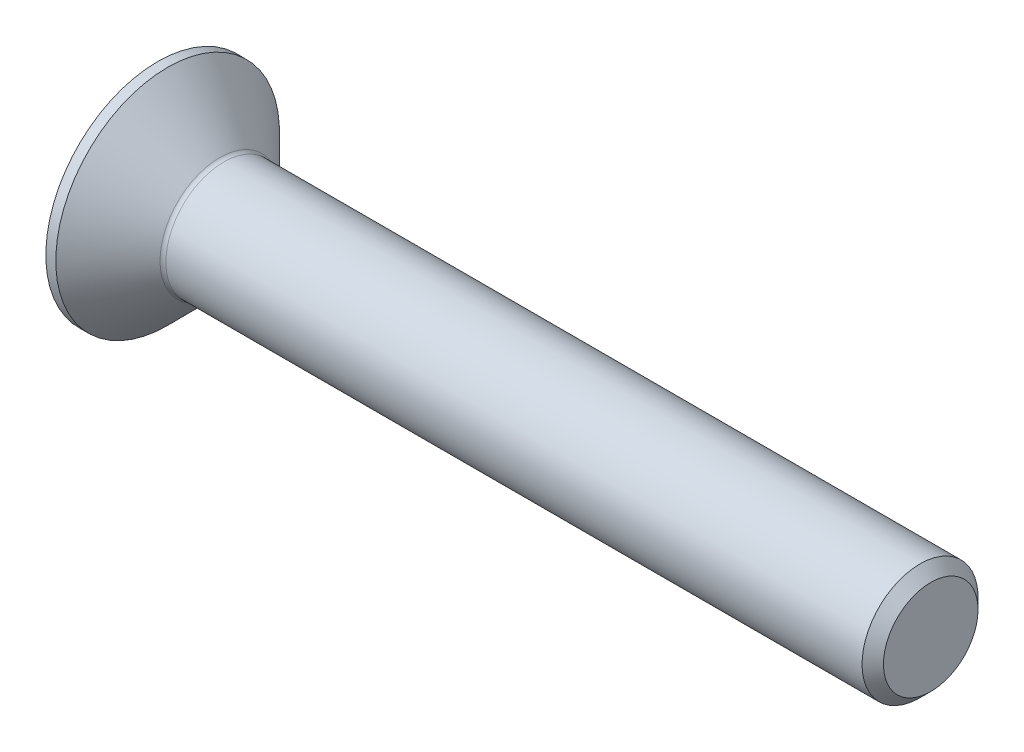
ISO-10303-21;
HEADER;
FILE_DESCRIPTION(('STEP AP214'),'2;1');
FILE_NAME('part.step','',(''),(''),'','','');
FILE_SCHEMA(('AUTOMOTIVE_DESIGN { 1 0 10303 214 1 1 1 1 }'));
ENDSEC;
DATA;
#1=APPLICATION_CONTEXT('core data for automotive mechanical design processes');
#2=APPLICATION_PROTOCOL_DEFINITION('international standard','automotive_design',2000,#1);
#3=PRODUCT_CONTEXT('',#1,'mechanical');
#4=PRODUCT('Part','Part','',(#3));
#5=PRODUCT_RELATED_PRODUCT_CATEGORY('part','',(#4));
#6=PRODUCT_DEFINITION_FORMATION('','',#4);
#7=PRODUCT_DEFINITION_CONTEXT('part definition',#1,'design');
#8=PRODUCT_DEFINITION('design','',#6,#7);
#9=PRODUCT_DEFINITION_SHAPE('','',#8);
#10=(LENGTH_UNIT() NAMED_UNIT(*) SI_UNIT(.MILLI.,.METRE.));
#11=(NAMED_UNIT(*) PLANE_ANGLE_UNIT() SI_UNIT($,.RADIAN.));
#12=(NAMED_UNIT(*) SI_UNIT($,.STERADIAN.) SOLID_ANGLE_UNIT());
#13=UNCERTAINTY_MEASURE_WITH_UNIT(LENGTH_MEASURE(1.E-05),#10,'distance_accuracy_value','');
#14=(GEOMETRIC_REPRESENTATION_CONTEXT(3) GLOBAL_UNCERTAINTY_ASSIGNED_CONTEXT((#13)) GLOBAL_UNIT_ASSIGNED_CONTEXT((#10,
#11,#12)) REPRESENTATION_CONTEXT('',''));
#15=CARTESIAN_POINT('',(0.,0.,0.));
#16=DIRECTION('',(0.,0.,1.));
#17=DIRECTION('',(1.,0.,0.));
#18=AXIS2_PLACEMENT_3D('',#15,#16,#17);
#19=CARTESIAN_POINT('',(0.,0.,0.));
#20=DIRECTION('',(-1.,0.,0.));
#21=DIRECTION('',(0.,-1.,0.));
#22=AXIS2_PLACEMENT_3D('',#19,#20,#21);
#23=PLANE('',#22);
#24=DIRECTION('',(0.,0.5,0.866025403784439));
#25=VECTOR('',#24,1.);
#26=CARTESIAN_POINT('',(0.,-2.32094808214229,0.));
#27=LINE('',#26,#25);
#28=CARTESIAN_POINT('',(0.,-2.32094808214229,0.));
#29=VERTEX_POINT('',#28);
#30=CARTESIAN_POINT('',(0.,-1.16047404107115,2.01));
#31=VERTEX_POINT('',#30);
#32=EDGE_CURVE('E54',#29,#31,#27,.T.);
#33=ORIENTED_EDGE('',*,*,#32,.F.);
#34=DIRECTION('',(0.,-0.5,0.866025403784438));
#35=VECTOR('',#34,1.);
#36=CARTESIAN_POINT('',(0.,-1.16047404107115,-2.01));
#37=LINE('',#36,#35);
#38=CARTESIAN_POINT('',(0.,-1.16047404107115,-2.01));
#39=VERTEX_POINT('',#38);
#40=EDGE_CURVE('E150',#39,#29,#37,.T.);
#41=ORIENTED_EDGE('',*,*,#40,.F.);
#42=DIRECTION('',(0.,-1.,0.));
#43=VECTOR('',#42,1.);
#44=CARTESIAN_POINT('',(0.,1.16047404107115,-2.01));
#45=LINE('',#44,#43);
#46=CARTESIAN_POINT('',(0.,1.16047404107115,-2.01));
#47=VERTEX_POINT('',#46);
#48=EDGE_CURVE('E147',#47,#39,#45,.T.);
#49=ORIENTED_EDGE('',*,*,#48,.F.);
#50=DIRECTION('',(0.,-0.5,-0.866025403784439));
#51=VECTOR('',#50,1.);
#52=CARTESIAN_POINT('',(0.,2.32094808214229,0.));
#53=LINE('',#52,#51);
#54=CARTESIAN_POINT('',(0.,2.32094808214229,0.));
#55=VERTEX_POINT('',#54);
#56=EDGE_CURVE('E104',#55,#47,#53,.T.);
#57=ORIENTED_EDGE('',*,*,#56,.F.);
#58=DIRECTION('',(0.,0.5,-0.866025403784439));
#59=VECTOR('',#58,1.);
#60=CARTESIAN_POINT('',(0.,1.16047404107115,2.01));
#61=LINE('',#60,#59);
#62=CARTESIAN_POINT('',(0.,1.16047404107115,2.01));
#63=VERTEX_POINT('',#62);
#64=EDGE_CURVE('E141',#63,#55,#61,.T.);
#65=ORIENTED_EDGE('',*,*,#64,.F.);
#66=DIRECTION('',(0.,1.,0.));
#67=VECTOR('',#66,1.);
#68=CARTESIAN_POINT('',(0.,-1.16047404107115,2.01));
#69=LINE('',#68,#67);
#70=EDGE_CURVE('E136',#31,#63,#69,.T.);
#71=ORIENTED_EDGE('',*,*,#70,.F.);
#72=EDGE_LOOP('',(#33,#41,#49,#57,#65,#71));
#73=FACE_BOUND('',#72,.T.);
#74=CARTESIAN_POINT('',(0.,0.,0.));
#75=DIRECTION('',(1.,0.,0.));
#76=DIRECTION('',(0.,1.,0.));
#77=AXIS2_PLACEMENT_3D('',#74,#75,#76);
#78=CIRCLE('',#77,5.785);
#79=CARTESIAN_POINT('',(0.,5.785,0.));
#80=VERTEX_POINT('',#79);
#81=EDGE_CURVE('E156',#80,#80,#78,.T.);
#82=ORIENTED_EDGE('',*,*,#81,.F.);
#83=EDGE_LOOP('',(#82));
#84=FACE_BOUND('',#83,.T.);
#85=ADVANCED_FACE('F39',(#73,#84),#23,.T.);
#86=CARTESIAN_POINT('',(40.,2.44550000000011,0.));
#87=DIRECTION('',(1.,0.,0.));
#88=DIRECTION('',(0.,1.,0.));
#89=AXIS2_PLACEMENT_3D('',#86,#87,#88);
#90=PLANE('',#89);
#91=CARTESIAN_POINT('',(40.,0.,0.));
#92=DIRECTION('',(1.,0.,0.));
#93=DIRECTION('',(0.,1.,0.));
#94=AXIS2_PLACEMENT_3D('',#91,#92,#93);
#95=CIRCLE('',#94,2.44550000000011);
#96=CARTESIAN_POINT('',(40.,2.44550000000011,0.));
#97=VERTEX_POINT('',#96);
#98=EDGE_CURVE('E11',#97,#97,#95,.T.);
#99=ORIENTED_EDGE('',*,*,#98,.T.);
#100=EDGE_LOOP('',(#99));
#101=FACE_BOUND('',#100,.T.);
#102=ADVANCED_FACE('F199',(#101),#90,.T.);
#103=CARTESIAN_POINT('',(40.,0.,0.));
#104=DIRECTION('',(-1.,0.,0.));
#105=DIRECTION('',(0.,-1.,0.));
#106=AXIS2_PLACEMENT_3D('',#103,#104,#105);
#107=CONICAL_SURFACE('',#106,2.44550000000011,0.785398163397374);
#108=CARTESIAN_POINT('',(39.4455,0.,0.));
#109=DIRECTION('',(1.,0.,0.));
#110=DIRECTION('',(0.,1.,0.));
#111=AXIS2_PLACEMENT_3D('',#108,#109,#110);
#112=CIRCLE('',#111,3.);
#113=CARTESIAN_POINT('',(39.4455,3.,0.));
#114=VERTEX_POINT('',#113);
#115=EDGE_CURVE('E47',#114,#114,#112,.T.);
#116=ORIENTED_EDGE('',*,*,#115,.T.);
#117=EDGE_LOOP('',(#116));
#118=FACE_BOUND('',#117,.T.);
#119=ORIENTED_EDGE('',*,*,#98,.F.);
#120=EDGE_LOOP('',(#119));
#121=FACE_BOUND('',#120,.T.);
#122=ADVANCED_FACE('F184',(#118,#121),#107,.T.);
#123=CARTESIAN_POINT('',(40.,0.,0.));
#124=DIRECTION('',(1.,0.,0.));
#125=DIRECTION('',(0.,1.,0.));
#126=AXIS2_PLACEMENT_3D('',#123,#124,#125);
#127=CYLINDRICAL_SURFACE('',#126,3.);
#128=CARTESIAN_POINT('',(3.42426406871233,0.,0.));
#129=DIRECTION('',(1.,0.,0.));
#130=DIRECTION('',(0.,1.,0.));
#131=AXIS2_PLACEMENT_3D('',#128,#129,#130);
#132=CIRCLE('',#131,3.);
#133=CARTESIAN_POINT('',(3.42426406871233,3.,0.));
#134=VERTEX_POINT('',#133);
#135=EDGE_CURVE('E177',#134,#134,#132,.T.);
#136=ORIENTED_EDGE('',*,*,#135,.T.);
#137=EDGE_LOOP('',(#136));
#138=FACE_BOUND('',#137,.T.);
#139=ORIENTED_EDGE('',*,*,#115,.F.);
#140=EDGE_LOOP('',(#139));
#141=FACE_BOUND('',#140,.T.);
#142=ADVANCED_FACE('F187',(#138,#141),#127,.T.);
#143=CARTESIAN_POINT('',(3.42426406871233,0.,0.));
#144=DIRECTION('',(1.,0.,0.));
#145=DIRECTION('',(0.,1.,0.));
#146=AXIS2_PLACEMENT_3D('',#143,#144,#145);
#147=TOROIDAL_SURFACE('',#146,3.3,0.300000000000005);
#148=CARTESIAN_POINT('',(3.21213203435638,0.,0.));
#149=DIRECTION('',(1.,0.,0.));
#150=DIRECTION('',(0.,1.,0.));
#151=AXIS2_PLACEMENT_3D('',#148,#149,#150);
#152=CIRCLE('',#151,3.08786796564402);
#153=CARTESIAN_POINT('',(3.21213203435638,3.08786796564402,0.));
#154=VERTEX_POINT('',#153);
#155=EDGE_CURVE('E173',#154,#154,#152,.T.);
#156=ORIENTED_EDGE('',*,*,#155,.T.);
#157=EDGE_LOOP('',(#156));
#158=FACE_BOUND('',#157,.T.);
#159=ORIENTED_EDGE('',*,*,#135,.F.);
#160=EDGE_LOOP('',(#159));
#161=FACE_BOUND('',#160,.T.);
#162=ADVANCED_FACE('F189',(#158,#161),#147,.F.);
#163=CARTESIAN_POINT('',(3.21213203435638,0.,0.));
#164=DIRECTION('',(-1.,0.,0.));
#165=DIRECTION('',(0.,-1.,0.));
#166=AXIS2_PLACEMENT_3D('',#163,#164,#165);
#167=CONICAL_SURFACE('',#166,3.08786796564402,0.785398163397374);
#168=CARTESIAN_POINT('',(0.514999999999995,0.,0.));
#169=DIRECTION('',(1.,0.,0.));
#170=DIRECTION('',(0.,1.,0.));
#171=AXIS2_PLACEMENT_3D('',#168,#169,#170);
#172=CIRCLE('',#171,5.785);
#173=CARTESIAN_POINT('',(0.514999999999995,5.785,0.));
#174=VERTEX_POINT('',#173);
#175=EDGE_CURVE('E169',#174,#174,#172,.T.);
#176=ORIENTED_EDGE('',*,*,#175,.T.);
#177=EDGE_LOOP('',(#176));
#178=FACE_BOUND('',#177,.T.);
#179=ORIENTED_EDGE('',*,*,#155,.F.);
#180=EDGE_LOOP('',(#179));
#181=FACE_BOUND('',#180,.T.);
#182=ADVANCED_FACE('F196',(#178,#181),#167,.T.);
#183=CARTESIAN_POINT('',(40.,0.,0.));
#184=DIRECTION('',(1.,0.,0.));
#185=DIRECTION('',(0.,1.,0.));
#186=AXIS2_PLACEMENT_3D('',#183,#184,#185);
#187=CYLINDRICAL_SURFACE('',#186,5.785);
#188=ORIENTED_EDGE('',*,*,#81,.T.);
#189=EDGE_LOOP('',(#188));
#190=FACE_BOUND('',#189,.T.);
#191=ORIENTED_EDGE('',*,*,#175,.F.);
#192=EDGE_LOOP('',(#191));
#193=FACE_BOUND('',#192,.T.);
#194=ADVANCED_FACE('F212',(#190,#193),#187,.T.);
#195=CARTESIAN_POINT('',(2.5,-2.32094808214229,0.));
#196=DIRECTION('',(0.,-0.866025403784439,0.5));
#197=DIRECTION('',(0.,-0.5,-0.866025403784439));
#198=AXIS2_PLACEMENT_3D('',#195,#196,#197);
#199=PLANE('',#198);
#200=ORIENTED_EDGE('',*,*,#32,.T.);
#201=DIRECTION('',(-1.,0.,0.));
#202=VECTOR('',#201,1.);
#203=CARTESIAN_POINT('',(2.5,-1.16047404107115,2.01));
#204=LINE('',#203,#202);
#205=CARTESIAN_POINT('',(2.5,-1.16047404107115,2.01));
#206=VERTEX_POINT('',#205);
#207=EDGE_CURVE('E85',#206,#31,#204,.T.);
#208=ORIENTED_EDGE('',*,*,#207,.F.);
#209=DIRECTION('',(0.,0.5,0.866025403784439));
#210=VECTOR('',#209,1.);
#211=CARTESIAN_POINT('',(2.5,-2.32094808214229,0.));
#212=LINE('',#211,#210);
#213=CARTESIAN_POINT('',(2.5,-2.32094808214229,0.));
#214=VERTEX_POINT('',#213);
#215=EDGE_CURVE('E153',#214,#206,#212,.T.);
#216=ORIENTED_EDGE('',*,*,#215,.F.);
#217=DIRECTION('',(-1.,0.,0.));
#218=VECTOR('',#217,1.);
#219=CARTESIAN_POINT('',(2.5,-2.32094808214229,0.));
#220=LINE('',#219,#218);
#221=EDGE_CURVE('E62',#214,#29,#220,.T.);
#222=ORIENTED_EDGE('',*,*,#221,.T.);
#223=EDGE_LOOP('',(#200,#208,#216,#222));
#224=FACE_BOUND('',#223,.T.);
#225=ADVANCED_FACE('F215',(#224),#199,.F.);
#226=CARTESIAN_POINT('',(2.5,-1.16047404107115,-2.01));
#227=DIRECTION('',(0.,-0.866025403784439,-0.5));
#228=DIRECTION('',(0.,0.5,-0.866025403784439));
#229=AXIS2_PLACEMENT_3D('',#226,#227,#228);
#230=PLANE('',#229);
#231=ORIENTED_EDGE('',*,*,#40,.T.);
#232=ORIENTED_EDGE('',*,*,#221,.F.);
#233=DIRECTION('',(0.,-0.5,0.866025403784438));
#234=VECTOR('',#233,1.);
#235=CARTESIAN_POINT('',(2.5,-1.16047404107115,-2.01));
#236=LINE('',#235,#234);
#237=CARTESIAN_POINT('',(2.5,-1.16047404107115,-2.01));
#238=VERTEX_POINT('',#237);
#239=EDGE_CURVE('E118',#238,#214,#236,.T.);
#240=ORIENTED_EDGE('',*,*,#239,.F.);
#241=DIRECTION('',(-1.,0.,0.));
#242=VECTOR('',#241,1.);
#243=CARTESIAN_POINT('',(2.5,-1.16047404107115,-2.01));
#244=LINE('',#243,#242);
#245=EDGE_CURVE('E109',#238,#39,#244,.T.);
#246=ORIENTED_EDGE('',*,*,#245,.T.);
#247=EDGE_LOOP('',(#231,#232,#240,#246));
#248=FACE_BOUND('',#247,.T.);
#249=ADVANCED_FACE('F230',(#248),#230,.F.);
#250=CARTESIAN_POINT('',(2.5,1.16047404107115,-2.01));
#251=DIRECTION('',(0.,0.,-1.));
#252=DIRECTION('',(-1.,0.,0.));
#253=AXIS2_PLACEMENT_3D('',#250,#251,#252);
#254=PLANE('',#253);
#255=ORIENTED_EDGE('',*,*,#48,.T.);
#256=ORIENTED_EDGE('',*,*,#245,.F.);
#257=DIRECTION('',(0.,-1.,0.));
#258=VECTOR('',#257,1.);
#259=CARTESIAN_POINT('',(2.5,1.16047404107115,-2.01));
#260=LINE('',#259,#258);
#261=CARTESIAN_POINT('',(2.5,1.16047404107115,-2.01));
#262=VERTEX_POINT('',#261);
#263=EDGE_CURVE('E113',#262,#238,#260,.T.);
#264=ORIENTED_EDGE('',*,*,#263,.F.);
#265=DIRECTION('',(-1.,0.,0.));
#266=VECTOR('',#265,1.);
#267=CARTESIAN_POINT('',(2.5,1.16047404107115,-2.01));
#268=LINE('',#267,#266);
#269=EDGE_CURVE('E97',#262,#47,#268,.T.);
#270=ORIENTED_EDGE('',*,*,#269,.T.);
#271=EDGE_LOOP('',(#255,#256,#264,#270));
#272=FACE_BOUND('',#271,.T.);
#273=ADVANCED_FACE('F114',(#272),#254,.F.);
#274=CARTESIAN_POINT('',(2.5,2.32094808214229,0.));
#275=DIRECTION('',(0.,0.866025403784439,-0.5));
#276=DIRECTION('',(0.,0.5,0.866025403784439));
#277=AXIS2_PLACEMENT_3D('',#274,#275,#276);
#278=PLANE('',#277);
#279=ORIENTED_EDGE('',*,*,#56,.T.);
#280=ORIENTED_EDGE('',*,*,#269,.F.);
#281=DIRECTION('',(0.,-0.5,-0.866025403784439));
#282=VECTOR('',#281,1.);
#283=CARTESIAN_POINT('',(2.5,2.32094808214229,0.));
#284=LINE('',#283,#282);
#285=CARTESIAN_POINT('',(2.5,2.32094808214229,0.));
#286=VERTEX_POINT('',#285);
#287=EDGE_CURVE('E101',#286,#262,#284,.T.);
#288=ORIENTED_EDGE('',*,*,#287,.F.);
#289=DIRECTION('',(-1.,0.,0.));
#290=VECTOR('',#289,1.);
#291=CARTESIAN_POINT('',(2.5,2.32094808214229,0.));
#292=LINE('',#291,#290);
#293=EDGE_CURVE('E110',#286,#55,#292,.T.);
#294=ORIENTED_EDGE('',*,*,#293,.T.);
#295=EDGE_LOOP('',(#279,#280,#288,#294));
#296=FACE_BOUND('',#295,.T.);
#297=ADVANCED_FACE('F99',(#296),#278,.F.);
#298=CARTESIAN_POINT('',(2.5,1.16047404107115,2.01));
#299=DIRECTION('',(0.,0.866025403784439,0.5));
#300=DIRECTION('',(0.,-0.5,0.866025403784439));
#301=AXIS2_PLACEMENT_3D('',#298,#299,#300);
#302=PLANE('',#301);
#303=ORIENTED_EDGE('',*,*,#64,.T.);
#304=ORIENTED_EDGE('',*,*,#293,.F.);
#305=DIRECTION('',(0.,0.5,-0.866025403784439));
#306=VECTOR('',#305,1.);
#307=CARTESIAN_POINT('',(2.5,1.16047404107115,2.01));
#308=LINE('',#307,#306);
#309=CARTESIAN_POINT('',(2.5,1.16047404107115,2.01));
#310=VERTEX_POINT('',#309);
#311=EDGE_CURVE('E124',#310,#286,#308,.T.);
#312=ORIENTED_EDGE('',*,*,#311,.F.);
#313=DIRECTION('',(-1.,0.,0.));
#314=VECTOR('',#313,1.);
#315=CARTESIAN_POINT('',(2.5,1.16047404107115,2.01));
#316=LINE('',#315,#314);
#317=EDGE_CURVE('E161',#310,#63,#316,.T.);
#318=ORIENTED_EDGE('',*,*,#317,.T.);
#319=EDGE_LOOP('',(#303,#304,#312,#318));
#320=FACE_BOUND('',#319,.T.);
#321=ADVANCED_FACE('F234',(#320),#302,.F.);
#322=CARTESIAN_POINT('',(2.5,-1.16047404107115,2.01));
#323=DIRECTION('',(0.,0.,1.));
#324=DIRECTION('',(1.,0.,0.));
#325=AXIS2_PLACEMENT_3D('',#322,#323,#324);
#326=PLANE('',#325);
#327=ORIENTED_EDGE('',*,*,#70,.T.);
#328=ORIENTED_EDGE('',*,*,#317,.F.);
#329=DIRECTION('',(0.,1.,0.));
#330=VECTOR('',#329,1.);
#331=CARTESIAN_POINT('',(2.5,-1.16047404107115,2.01));
#332=LINE('',#331,#330);
#333=EDGE_CURVE('E128',#206,#310,#332,.T.);
#334=ORIENTED_EDGE('',*,*,#333,.F.);
#335=ORIENTED_EDGE('',*,*,#207,.T.);
#336=EDGE_LOOP('',(#327,#328,#334,#335));
#337=FACE_BOUND('',#336,.T.);
#338=ADVANCED_FACE('F231',(#337),#326,.F.);
#339=CARTESIAN_POINT('',(2.5,0.,0.));
#340=DIRECTION('',(-1.,0.,0.));
#341=DIRECTION('',(0.,-1.,0.));
#342=AXIS2_PLACEMENT_3D('',#339,#340,#341);
#343=PLANE('',#342);
#344=CARTESIAN_POINT('',(2.5,0.,0.));
#345=DIRECTION('',(-1.,0.,0.));
#346=DIRECTION('',(0.,0.,1.));
#347=AXIS2_PLACEMENT_3D('',#344,#345,#346);
#348=CIRCLE('',#347,2.);
#349=CARTESIAN_POINT('',(2.5,0.,2.));
#350=VERTEX_POINT('',#349);
#351=EDGE_CURVE('E137',#350,#350,#348,.T.);
#352=ORIENTED_EDGE('',*,*,#351,.F.);
#353=EDGE_LOOP('',(#352));
#354=FACE_BOUND('',#353,.T.);
#355=ORIENTED_EDGE('',*,*,#215,.T.);
#356=ORIENTED_EDGE('',*,*,#333,.T.);
#357=ORIENTED_EDGE('',*,*,#311,.T.);
#358=ORIENTED_EDGE('',*,*,#287,.T.);
#359=ORIENTED_EDGE('',*,*,#263,.T.);
#360=ORIENTED_EDGE('',*,*,#239,.T.);
#361=EDGE_LOOP('',(#355,#356,#357,#358,#359,#360));
#362=FACE_BOUND('',#361,.T.);
#363=ADVANCED_FACE('F121',(#354,#362),#343,.T.);
#364=CARTESIAN_POINT('',(3.66,0.,0.));
#365=DIRECTION('',(-1.,0.,0.));
#366=DIRECTION('',(0.,0.,1.));
#367=AXIS2_PLACEMENT_3D('',#364,#365,#366);
#368=CONICAL_SURFACE('',#367,0.,1.04521253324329);
#369=ORIENTED_EDGE('',*,*,#351,.T.);
#370=EDGE_LOOP('',(#369));
#371=FACE_BOUND('',#370,.T.);
#372=CARTESIAN_POINT('',(3.66,0.,0.));
#373=VERTEX_POINT('',#372);
#374=VERTEX_LOOP('',#373);
#375=FACE_BOUND('',#374,.T.);
#376=ADVANCED_FACE('F247',(#371,#375),#368,.F.);
#377=CLOSED_SHELL('',(#85,#102,#122,#142,#162,#182,#194,#225,#249,#273,#297,#321,#338,#363,#376));
#378=MANIFOLD_SOLID_BREP('B2',#377);
#379=ADVANCED_BREP_SHAPE_REPRESENTATION('',(#18,#378),#14);
#380=SHAPE_DEFINITION_REPRESENTATION(#9,#379);
ENDSEC;
END-ISO-10303-21;
